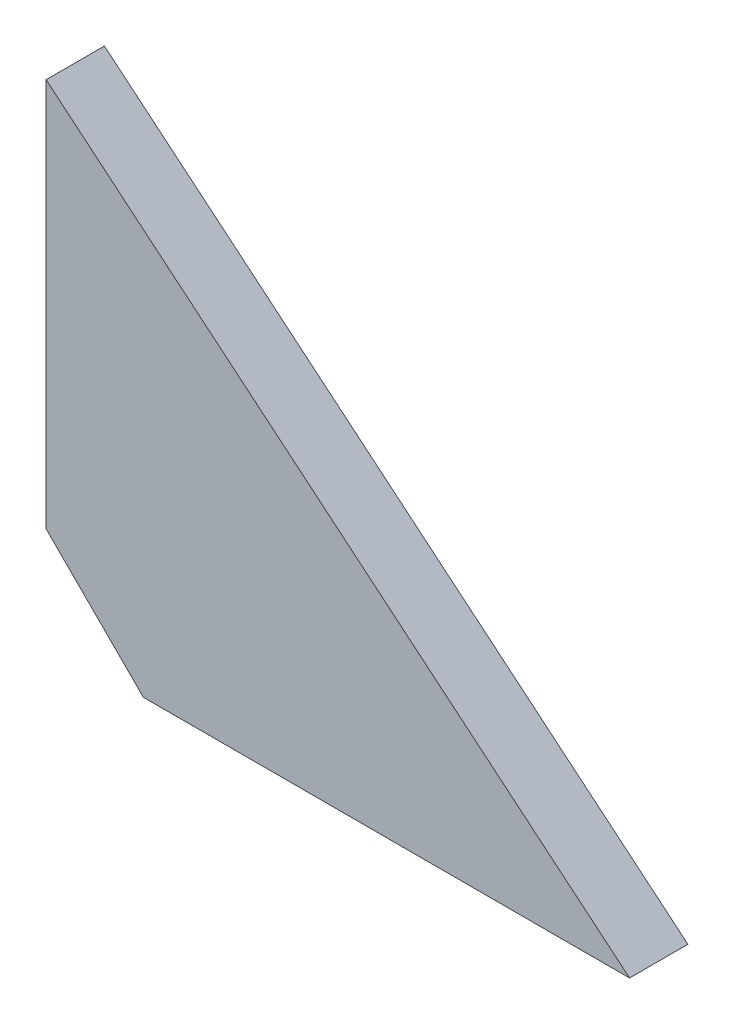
from build123d import *

# Parameters (mm, degrees)
EXTRUDE_1_DEPTH = 6
CHAMFER_1_SIZE  = 10


with BuildPart() as part:
    # Sketch 1 → Extrude 1 (new body)
    with BuildSketch(Plane.XY):
        Polygon((0, 50), (0, 0), (60, 0), align=None)
    extrude(amount=EXTRUDE_1_DEPTH)

    # Chamfer 1
    chamfer_1_edges = [part.edges().sort_by_distance(p)[0] for p in [
        (0, 0, 3),
    ]]
    chamfer(chamfer_1_edges, length=CHAMFER_1_SIZE)


solid = part.part
